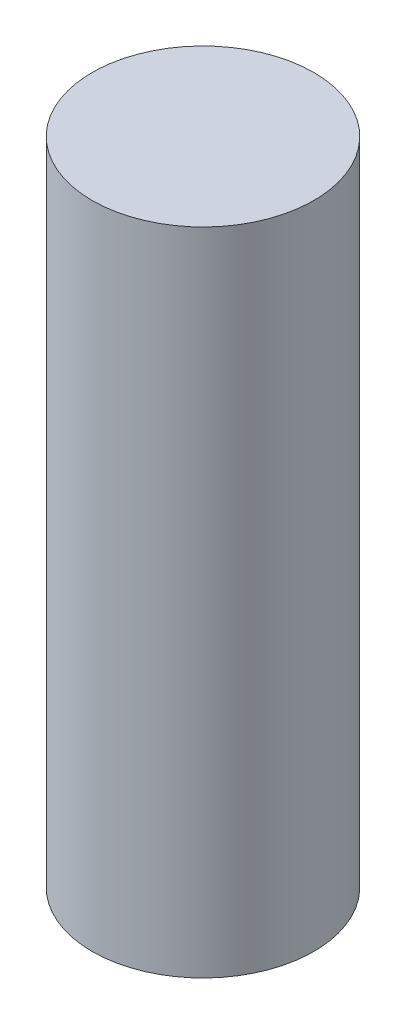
from build123d import *

# Parameters (mm, degrees)
SKETCH1_R      = 9.525
EXTRUDE1_DEPTH = 55.88


with BuildPart() as part:
    # Sketch1 → Extrude1 (new body)
    with BuildSketch(Plane(origin=(0, 0, 0), x_dir=(1, 0, 0), z_dir=(0, 1, 0))):
        with Locations(Location((0, 0, 0), (0, 0, 270))):
            Circle(SKETCH1_R)
    extrude(amount=EXTRUDE1_DEPTH)


solid = part.part
